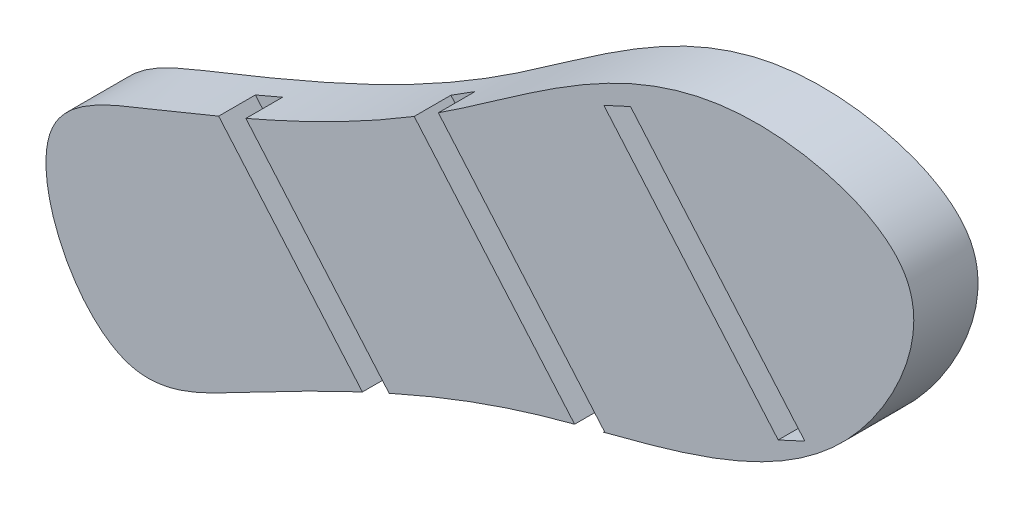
ISO-10303-21;
HEADER;
FILE_DESCRIPTION(('STEP AP214'),'2;1');
FILE_NAME('part.step','',(''),(''),'','','');
FILE_SCHEMA(('AUTOMOTIVE_DESIGN { 1 0 10303 214 1 1 1 1 }'));
ENDSEC;
DATA;
#1=APPLICATION_CONTEXT('core data for automotive mechanical design processes');
#2=APPLICATION_PROTOCOL_DEFINITION('international standard','automotive_design',2000,#1);
#3=PRODUCT_CONTEXT('',#1,'mechanical');
#4=PRODUCT('Part','Part','',(#3));
#5=PRODUCT_RELATED_PRODUCT_CATEGORY('part','',(#4));
#6=PRODUCT_DEFINITION_FORMATION('','',#4);
#7=PRODUCT_DEFINITION_CONTEXT('part definition',#1,'design');
#8=PRODUCT_DEFINITION('design','',#6,#7);
#9=PRODUCT_DEFINITION_SHAPE('','',#8);
#10=(LENGTH_UNIT() NAMED_UNIT(*) SI_UNIT(.MILLI.,.METRE.));
#11=(NAMED_UNIT(*) PLANE_ANGLE_UNIT() SI_UNIT($,.RADIAN.));
#12=(NAMED_UNIT(*) SI_UNIT($,.STERADIAN.) SOLID_ANGLE_UNIT());
#13=UNCERTAINTY_MEASURE_WITH_UNIT(LENGTH_MEASURE(1.E-05),#10,'distance_accuracy_value','');
#14=(GEOMETRIC_REPRESENTATION_CONTEXT(3) GLOBAL_UNCERTAINTY_ASSIGNED_CONTEXT((#13)) GLOBAL_UNIT_ASSIGNED_CONTEXT((#10,
#11,#12)) REPRESENTATION_CONTEXT('',''));
#15=CARTESIAN_POINT('',(0.,0.,0.));
#16=DIRECTION('',(0.,0.,1.));
#17=DIRECTION('',(1.,0.,0.));
#18=AXIS2_PLACEMENT_3D('',#15,#16,#17);
#19=CARTESIAN_POINT('',(431.734976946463,343.776693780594,-16.));
#20=CARTESIAN_POINT('',(430.437738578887,340.897420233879,-16.));
#21=CARTESIAN_POINT('',(434.386282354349,332.342242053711,-16.));
#22=CARTESIAN_POINT('',(445.921336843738,338.542902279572,-16.));
#23=CARTESIAN_POINT('',(458.123888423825,344.531424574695,-16.));
#24=CARTESIAN_POINT('',(474.741212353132,346.583012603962,-16.));
#25=CARTESIAN_POINT('',(480.557784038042,360.803442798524,-16.));
#26=CARTESIAN_POINT('',(465.962705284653,365.603111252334,-16.));
#27=CARTESIAN_POINT('',(453.620501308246,354.288763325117,-16.));
#28=CARTESIAN_POINT('',(441.146604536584,348.888155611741,-16.));
#29=CARTESIAN_POINT('',(432.524056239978,345.528087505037,-16.));
#30=CARTESIAN_POINT('',(431.734976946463,343.776693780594,-16.));
#31=B_SPLINE_CURVE_WITH_KNOTS('',3,(#19,#20,#21,#22,#23,#24,#25,#26,#27,#28,#29,#30),
.UNSPECIFIED.,.T.,.F.,(4,1,1,1,1,1,1,1,1,4),(0.,0.0878712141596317,0.141321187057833,
0.299528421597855,0.475305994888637,0.543935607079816,0.612565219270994,0.788342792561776,
0.946550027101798,1.),.UNSPECIFIED.);
#32=DIRECTION('',(0.,0.,1.));
#33=VECTOR('',#32,1.);
#34=SURFACE_OF_LINEAR_EXTRUSION('',#31,#33);
#35=CARTESIAN_POINT('',(431.734976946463,343.776693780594,-16.));
#36=VERTEX_POINT('',#35);
#37=EDGE_CURVE('E223',#36,#36,#31,.T.);
#38=ORIENTED_EDGE('',*,*,#37,.T.);
#39=EDGE_LOOP('',(#38));
#40=FACE_BOUND('',#39,.T.);
#41=DIRECTION('',(0.,0.,1.));
#42=VECTOR('',#41,1.);
#43=CARTESIAN_POINT('',(451.438377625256,354.15385663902,-16.));
#44=LINE('',#43,#42);
#45=CARTESIAN_POINT('',(451.438377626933,354.153856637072,-12.5));
#46=VERTEX_POINT('',#45);
#47=CARTESIAN_POINT('',(451.438377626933,354.153856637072,-14.5));
#48=VERTEX_POINT('',#47);
#49=EDGE_CURVE('E215',#46,#48,#44,.F.);
#50=ORIENTED_EDGE('',*,*,#49,.T.);
#51=CARTESIAN_POINT('',(431.734976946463,343.776693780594,-14.5));
#52=CARTESIAN_POINT('',(430.437738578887,340.897420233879,-14.5));
#53=CARTESIAN_POINT('',(434.386282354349,332.342242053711,-14.5));
#54=CARTESIAN_POINT('',(445.921336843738,338.542902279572,-14.5));
#55=CARTESIAN_POINT('',(458.123888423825,344.531424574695,-14.5));
#56=CARTESIAN_POINT('',(474.741212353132,346.583012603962,-14.5));
#57=CARTESIAN_POINT('',(480.557784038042,360.803442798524,-14.5));
#58=CARTESIAN_POINT('',(465.962705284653,365.603111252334,-14.5));
#59=CARTESIAN_POINT('',(453.620501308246,354.288763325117,-14.5));
#60=CARTESIAN_POINT('',(441.146604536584,348.888155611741,-14.5));
#61=CARTESIAN_POINT('',(432.524056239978,345.528087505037,-14.5));
#62=CARTESIAN_POINT('',(431.734976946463,343.776693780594,-14.5));
#63=B_SPLINE_CURVE_WITH_KNOTS('',3,(#51,#52,#53,#54,#55,#56,#57,#58,#59,#60,#61,#62),
.UNSPECIFIED.,.T.,.F.,(4,1,1,1,1,1,1,1,1,4),(0.,0.0878712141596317,0.141321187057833,
0.299528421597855,0.475305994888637,0.543935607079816,0.612565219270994,0.788342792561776,
0.946550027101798,1.),.UNSPECIFIED.);
#64=CARTESIAN_POINT('',(452.753720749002,354.983966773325,-14.5));
#65=VERTEX_POINT('',#64);
#66=EDGE_CURVE('E11',#48,#65,#63,.F.);
#67=ORIENTED_EDGE('',*,*,#66,.T.);
#68=DIRECTION('',(0.,0.,1.));
#69=VECTOR('',#68,1.);
#70=CARTESIAN_POINT('',(452.753720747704,354.983966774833,-16.));
#71=LINE('',#70,#69);
#72=CARTESIAN_POINT('',(452.753720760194,354.983966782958,-12.5));
#73=VERTEX_POINT('',#72);
#74=EDGE_CURVE('E207',#65,#73,#71,.T.);
#75=ORIENTED_EDGE('',*,*,#74,.T.);
#76=CARTESIAN_POINT('',(431.734976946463,343.776693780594,-12.5));
#77=CARTESIAN_POINT('',(430.437738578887,340.897420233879,-12.5));
#78=CARTESIAN_POINT('',(434.386282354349,332.342242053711,-12.5));
#79=CARTESIAN_POINT('',(445.921336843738,338.542902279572,-12.5));
#80=CARTESIAN_POINT('',(458.123888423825,344.531424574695,-12.5));
#81=CARTESIAN_POINT('',(474.741212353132,346.583012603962,-12.5));
#82=CARTESIAN_POINT('',(480.557784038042,360.803442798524,-12.5));
#83=CARTESIAN_POINT('',(465.962705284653,365.603111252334,-12.5));
#84=CARTESIAN_POINT('',(453.620501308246,354.288763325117,-12.5));
#85=CARTESIAN_POINT('',(441.146604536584,348.888155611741,-12.5));
#86=CARTESIAN_POINT('',(432.524056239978,345.528087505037,-12.5));
#87=CARTESIAN_POINT('',(431.734976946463,343.776693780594,-12.5));
#88=B_SPLINE_CURVE_WITH_KNOTS('',3,(#76,#77,#78,#79,#80,#81,#82,#83,#84,#85,#86,#87),
.UNSPECIFIED.,.T.,.F.,(4,1,1,1,1,1,1,1,1,4),(0.,0.0878712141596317,0.141321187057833,
0.299528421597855,0.475305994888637,0.543935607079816,0.612565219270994,0.788342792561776,
0.946550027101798,1.),.UNSPECIFIED.);
#89=CARTESIAN_POINT('',(461.754350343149,344.415338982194,-12.5));
#90=VERTEX_POINT('',#89);
#91=EDGE_CURVE('E285',#90,#73,#88,.T.);
#92=ORIENTED_EDGE('',*,*,#91,.F.);
#93=DIRECTION('',(0.,0.,1.));
#94=VECTOR('',#93,1.);
#95=CARTESIAN_POINT('',(461.754350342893,344.415338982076,-16.));
#96=LINE('',#95,#94);
#97=CARTESIAN_POINT('',(461.75435034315,344.415338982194,-14.5));
#98=VERTEX_POINT('',#97);
#99=EDGE_CURVE('E211',#90,#98,#96,.F.);
#100=ORIENTED_EDGE('',*,*,#99,.T.);
#101=CARTESIAN_POINT('',(460.176471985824,344.002247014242,-14.5));
#102=VERTEX_POINT('',#101);
#103=EDGE_CURVE('E43',#98,#102,#63,.F.);
#104=ORIENTED_EDGE('',*,*,#103,.T.);
#105=DIRECTION('',(0.,0.,1.));
#106=VECTOR('',#105,1.);
#107=CARTESIAN_POINT('',(460.176471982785,344.002247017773,-16.));
#108=LINE('',#107,#106);
#109=CARTESIAN_POINT('',(460.176471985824,344.002247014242,-12.5));
#110=VERTEX_POINT('',#109);
#111=EDGE_CURVE('E219',#102,#110,#108,.T.);
#112=ORIENTED_EDGE('',*,*,#111,.T.);
#113=CARTESIAN_POINT('',(450.072635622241,340.412036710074,-12.5));
#114=VERTEX_POINT('',#113);
#115=EDGE_CURVE('E230',#114,#110,#88,.T.);
#116=ORIENTED_EDGE('',*,*,#115,.F.);
#117=DIRECTION('',(0.,0.,1.));
#118=VECTOR('',#117,1.);
#119=CARTESIAN_POINT('',(450.07263562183,340.412036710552,-16.));
#120=LINE('',#119,#118);
#121=CARTESIAN_POINT('',(450.072635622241,340.412036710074,-14.5));
#122=VERTEX_POINT('',#121);
#123=EDGE_CURVE('E195',#114,#122,#120,.F.);
#124=ORIENTED_EDGE('',*,*,#123,.T.);
#125=CARTESIAN_POINT('',(431.734976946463,343.776693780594,-14.5));
#126=CARTESIAN_POINT('',(430.437738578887,340.897420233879,-14.5));
#127=CARTESIAN_POINT('',(434.386282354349,332.342242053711,-14.5));
#128=CARTESIAN_POINT('',(445.921336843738,338.542902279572,-14.5));
#129=CARTESIAN_POINT('',(458.123888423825,344.531424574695,-14.5));
#130=CARTESIAN_POINT('',(474.741212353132,346.583012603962,-14.5));
#131=CARTESIAN_POINT('',(480.557784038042,360.803442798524,-14.5));
#132=CARTESIAN_POINT('',(465.962705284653,365.603111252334,-14.5));
#133=CARTESIAN_POINT('',(453.620501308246,354.288763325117,-14.5));
#134=CARTESIAN_POINT('',(441.146604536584,348.888155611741,-14.5));
#135=CARTESIAN_POINT('',(432.524056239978,345.528087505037,-14.5));
#136=CARTESIAN_POINT('',(431.734976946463,343.776693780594,-14.5));
#137=B_SPLINE_CURVE_WITH_KNOTS('',3,(#125,#126,#127,#128,#129,#130,#131,#132,#133,#134,#135,
#136),.UNSPECIFIED.,.T.,.F.,(4,1,1,1,1,1,1,1,1,4),(0.,0.0878712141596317,0.141321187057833,
0.299528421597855,0.475305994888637,0.543935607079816,0.612565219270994,0.788342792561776,
0.946550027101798,1.),.UNSPECIFIED.);
#138=CARTESIAN_POINT('',(448.617521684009,339.744307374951,-14.5));
#139=VERTEX_POINT('',#138);
#140=EDGE_CURVE('E253',#122,#139,#137,.F.);
#141=ORIENTED_EDGE('',*,*,#140,.T.);
#142=DIRECTION('',(0.,0.,1.));
#143=VECTOR('',#142,1.);
#144=CARTESIAN_POINT('',(448.617521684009,339.744307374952,-16.));
#145=LINE('',#144,#143);
#146=CARTESIAN_POINT('',(448.617521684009,339.744307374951,-12.5));
#147=VERTEX_POINT('',#146);
#148=EDGE_CURVE('E203',#139,#147,#145,.T.);
#149=ORIENTED_EDGE('',*,*,#148,.T.);
#150=CARTESIAN_POINT('',(440.786957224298,348.84158079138,-12.5));
#151=VERTEX_POINT('',#150);
#152=EDGE_CURVE('E222',#151,#147,#88,.T.);
#153=ORIENTED_EDGE('',*,*,#152,.F.);
#154=DIRECTION('',(0.,0.,1.));
#155=VECTOR('',#154,1.);
#156=CARTESIAN_POINT('',(440.786957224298,348.84158079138,-16.));
#157=LINE('',#156,#155);
#158=CARTESIAN_POINT('',(440.786957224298,348.84158079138,-14.5));
#159=VERTEX_POINT('',#158);
#160=EDGE_CURVE('E199',#151,#159,#157,.F.);
#161=ORIENTED_EDGE('',*,*,#160,.T.);
#162=CARTESIAN_POINT('',(442.270356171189,349.476449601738,-14.5));
#163=VERTEX_POINT('',#162);
#164=EDGE_CURVE('E258',#159,#163,#137,.F.);
#165=ORIENTED_EDGE('',*,*,#164,.T.);
#166=DIRECTION('',(0.,0.,1.));
#167=VECTOR('',#166,1.);
#168=CARTESIAN_POINT('',(442.270356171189,349.476449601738,-16.));
#169=LINE('',#168,#167);
#170=CARTESIAN_POINT('',(442.270356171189,349.476449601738,-12.5));
#171=VERTEX_POINT('',#170);
#172=EDGE_CURVE('E191',#163,#171,#169,.T.);
#173=ORIENTED_EDGE('',*,*,#172,.T.);
#174=EDGE_CURVE('E239',#46,#171,#88,.T.);
#175=ORIENTED_EDGE('',*,*,#174,.F.);
#176=EDGE_LOOP('',(#50,#67,#75,#92,#100,#104,#112,#116,#124,#141,#149,#153,#161,#165,#173,#175));
#177=FACE_BOUND('',#176,.T.);
#178=ADVANCED_FACE('F39',(#40,#177),#34,.T.);
#179=CARTESIAN_POINT('',(477.88969650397,354.97162670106,-12.5));
#180=DIRECTION('',(0.,0.,-1.));
#181=DIRECTION('',(1.,0.,0.));
#182=AXIS2_PLACEMENT_3D('',#179,#180,#181);
#183=PLANE('',#182);
#184=DIRECTION('',(-0.652370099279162,0.757900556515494,0.));
#185=VECTOR('',#184,1.);
#186=CARTESIAN_POINT('',(462.291376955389,341.545225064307,-12.5));
#187=LINE('',#186,#185);
#188=EDGE_CURVE('E251',#110,#46,#187,.T.);
#189=ORIENTED_EDGE('',*,*,#188,.T.);
#190=ORIENTED_EDGE('',*,*,#174,.T.);
#191=DIRECTION('',(0.652370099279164,-0.757900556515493,0.));
#192=VECTOR('',#191,1.);
#193=CARTESIAN_POINT('',(454.712485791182,335.021622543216,-12.5));
#194=LINE('',#193,#192);
#195=EDGE_CURVE('E65',#171,#114,#194,.T.);
#196=ORIENTED_EDGE('',*,*,#195,.T.);
#197=ORIENTED_EDGE('',*,*,#115,.T.);
#198=EDGE_LOOP('',(#189,#190,#196,#197));
#199=FACE_BOUND('',#198,.T.);
#200=ADVANCED_FACE('F283',(#199),#183,.F.);
#201=DIRECTION('',(0.652370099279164,-0.757900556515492,0.));
#202=VECTOR('',#201,1.);
#203=CARTESIAN_POINT('',(471.266131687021,348.805391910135,-12.5));
#204=LINE('',#203,#202);
#205=CARTESIAN_POINT('',(461.767479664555,359.840590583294,-12.5));
#206=VERTEX_POINT('',#205);
#207=CARTESIAN_POINT('',(471.266131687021,348.805391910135,-12.5));
#208=VERTEX_POINT('',#207);
#209=EDGE_CURVE('E161',#206,#208,#204,.T.);
#210=ORIENTED_EDGE('',*,*,#209,.F.);
#211=DIRECTION('',(-0.907959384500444,-0.419058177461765,0.));
#212=VECTOR('',#211,1.);
#213=CARTESIAN_POINT('',(461.767479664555,359.840590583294,-12.5));
#214=LINE('',#213,#212);
#215=CARTESIAN_POINT('',(463.220214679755,360.511083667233,-12.5));
#216=VERTEX_POINT('',#215);
#217=EDGE_CURVE('E157',#216,#206,#214,.T.);
#218=ORIENTED_EDGE('',*,*,#217,.F.);
#219=DIRECTION('',(-0.652370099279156,0.757900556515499,0.));
#220=VECTOR('',#219,1.);
#221=CARTESIAN_POINT('',(463.220214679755,360.511083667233,-12.5));
#222=LINE('',#221,#220);
#223=CARTESIAN_POINT('',(472.718866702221,349.475884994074,-12.5));
#224=VERTEX_POINT('',#223);
#225=EDGE_CURVE('E451',#224,#216,#222,.T.);
#226=ORIENTED_EDGE('',*,*,#225,.F.);
#227=DIRECTION('',(0.907959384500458,0.419058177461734,0.));
#228=VECTOR('',#227,1.);
#229=CARTESIAN_POINT('',(472.718866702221,349.475884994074,-12.5));
#230=LINE('',#229,#228);
#231=EDGE_CURVE('E453',#208,#224,#230,.T.);
#232=ORIENTED_EDGE('',*,*,#231,.F.);
#233=EDGE_LOOP('',(#210,#218,#226,#232));
#234=FACE_BOUND('',#233,.T.);
#235=DIRECTION('',(-0.907959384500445,-0.419058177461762,0.));
#236=VECTOR('',#235,1.);
#237=CARTESIAN_POINT('',(479.072711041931,352.408428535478,-12.5));
#238=LINE('',#237,#236);
#239=CARTESIAN_POINT('',(461.823354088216,344.447186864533,-12.5));
#240=VERTEX_POINT('',#239);
#241=EDGE_CURVE('E248',#240,#90,#238,.T.);
#242=ORIENTED_EDGE('',*,*,#241,.T.);
#243=ORIENTED_EDGE('',*,*,#91,.T.);
#244=DIRECTION('',(-0.65237009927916,0.757900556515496,0.));
#245=VECTOR('',#244,1.);
#246=CARTESIAN_POINT('',(452.32470206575,355.482385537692,-12.5));
#247=LINE('',#246,#245);
#248=EDGE_CURVE('E163',#240,#73,#247,.T.);
#249=ORIENTED_EDGE('',*,*,#248,.F.);
#250=EDGE_LOOP('',(#242,#243,#249));
#251=FACE_BOUND('',#250,.T.);
#252=ADVANCED_FACE('F303',(#234,#251),#183,.F.);
#253=DIRECTION('',(-0.652370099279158,0.757900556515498,0.));
#254=VECTOR('',#253,1.);
#255=CARTESIAN_POINT('',(453.54650253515,334.017991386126,-12.5));
#256=LINE('',#255,#254);
#257=EDGE_CURVE('E245',#147,#151,#256,.T.);
#258=ORIENTED_EDGE('',*,*,#257,.T.);
#259=ORIENTED_EDGE('',*,*,#152,.T.);
#260=EDGE_LOOP('',(#258,#259));
#261=FACE_BOUND('',#260,.T.);
#262=ADVANCED_FACE('F300',(#261),#183,.F.);
#263=CARTESIAN_POINT('',(477.88969650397,354.97162670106,-16.));
#264=DIRECTION('',(0.,0.,-1.));
#265=DIRECTION('',(1.,0.,0.));
#266=AXIS2_PLACEMENT_3D('',#263,#264,#265);
#267=PLANE('',#266);
#268=ORIENTED_EDGE('',*,*,#37,.F.);
#269=EDGE_LOOP('',(#268));
#270=FACE_BOUND('',#269,.T.);
#271=ADVANCED_FACE('F302',(#270),#267,.T.);
#272=CARTESIAN_POINT('',(0.,0.,-14.5));
#273=DIRECTION('',(0.,0.,1.));
#274=DIRECTION('',(-1.,0.,0.));
#275=AXIS2_PLACEMENT_3D('',#272,#273,#274);
#276=PLANE('',#275);
#277=ORIENTED_EDGE('',*,*,#164,.F.);
#278=DIRECTION('',(0.652370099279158,-0.757900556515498,0.));
#279=VECTOR('',#278,1.);
#280=CARTESIAN_POINT('',(449.47510645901,338.747995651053,-14.5));
#281=LINE('',#280,#279);
#282=EDGE_CURVE('E185',#159,#139,#281,.T.);
#283=ORIENTED_EDGE('',*,*,#282,.T.);
#284=ORIENTED_EDGE('',*,*,#140,.F.);
#285=DIRECTION('',(-0.652370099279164,0.757900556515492,0.));
#286=VECTOR('',#285,1.);
#287=CARTESIAN_POINT('',(441.429189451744,350.453687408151,-14.5));
#288=LINE('',#287,#286);
#289=EDGE_CURVE('E188',#122,#163,#288,.T.);
#290=ORIENTED_EDGE('',*,*,#289,.T.);
#291=EDGE_LOOP('',(#277,#283,#284,#290));
#292=FACE_BOUND('',#291,.T.);
#293=ADVANCED_FACE('F293',(#292),#276,.T.);
#294=CARTESIAN_POINT('',(449.47510645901,338.747995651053,-14.5));
#295=DIRECTION('',(0.757900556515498,0.652370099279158,0.));
#296=DIRECTION('',(-0.652370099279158,0.757900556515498,0.));
#297=AXIS2_PLACEMENT_3D('',#294,#295,#296);
#298=PLANE('',#297);
#299=ORIENTED_EDGE('',*,*,#148,.F.);
#300=ORIENTED_EDGE('',*,*,#282,.F.);
#301=ORIENTED_EDGE('',*,*,#160,.F.);
#302=ORIENTED_EDGE('',*,*,#257,.F.);
#303=EDGE_LOOP('',(#299,#300,#301,#302));
#304=FACE_BOUND('',#303,.T.);
#305=ADVANCED_FACE('F297',(#304),#298,.T.);
#306=CARTESIAN_POINT('',(441.429189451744,350.453687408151,-14.5));
#307=DIRECTION('',(-0.757900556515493,-0.652370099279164,0.));
#308=DIRECTION('',(0.652370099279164,-0.757900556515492,0.));
#309=AXIS2_PLACEMENT_3D('',#306,#307,#308);
#310=PLANE('',#309);
#311=ORIENTED_EDGE('',*,*,#123,.F.);
#312=ORIENTED_EDGE('',*,*,#195,.F.);
#313=ORIENTED_EDGE('',*,*,#172,.F.);
#314=ORIENTED_EDGE('',*,*,#289,.F.);
#315=EDGE_LOOP('',(#311,#312,#313,#314));
#316=FACE_BOUND('',#315,.T.);
#317=ADVANCED_FACE('F291',(#316),#310,.T.);
#318=CARTESIAN_POINT('',(471.266131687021,348.805391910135,-14.5));
#319=DIRECTION('',(0.757900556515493,0.652370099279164,0.));
#320=DIRECTION('',(-0.652370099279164,0.757900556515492,0.));
#321=AXIS2_PLACEMENT_3D('',#318,#319,#320);
#322=PLANE('',#321);
#323=ORIENTED_EDGE('',*,*,#209,.T.);
#324=DIRECTION('',(0.,0.,1.));
#325=VECTOR('',#324,1.);
#326=CARTESIAN_POINT('',(471.266131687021,348.805391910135,-14.5));
#327=LINE('',#326,#325);
#328=CARTESIAN_POINT('',(471.266131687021,348.805391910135,-14.5));
#329=VERTEX_POINT('',#328);
#330=EDGE_CURVE('E145',#329,#208,#327,.T.);
#331=ORIENTED_EDGE('',*,*,#330,.F.);
#332=DIRECTION('',(0.652370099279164,-0.757900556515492,0.));
#333=VECTOR('',#332,1.);
#334=CARTESIAN_POINT('',(471.266131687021,348.805391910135,-14.5));
#335=LINE('',#334,#333);
#336=CARTESIAN_POINT('',(461.767479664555,359.840590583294,-14.5));
#337=VERTEX_POINT('',#336);
#338=EDGE_CURVE('E152',#337,#329,#335,.T.);
#339=ORIENTED_EDGE('',*,*,#338,.F.);
#340=DIRECTION('',(0.,0.,1.));
#341=VECTOR('',#340,1.);
#342=CARTESIAN_POINT('',(461.767479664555,359.840590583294,-14.5));
#343=LINE('',#342,#341);
#344=EDGE_CURVE('E57',#337,#206,#343,.T.);
#345=ORIENTED_EDGE('',*,*,#344,.T.);
#346=EDGE_LOOP('',(#323,#331,#339,#345));
#347=FACE_BOUND('',#346,.T.);
#348=ADVANCED_FACE('F159',(#347),#322,.T.);
#349=CARTESIAN_POINT('',(472.718866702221,349.475884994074,-14.5));
#350=DIRECTION('',(-0.419058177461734,0.907959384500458,0.));
#351=DIRECTION('',(-0.907959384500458,-0.419058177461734,0.));
#352=AXIS2_PLACEMENT_3D('',#349,#350,#351);
#353=PLANE('',#352);
#354=ORIENTED_EDGE('',*,*,#231,.T.);
#355=DIRECTION('',(0.,0.,1.));
#356=VECTOR('',#355,1.);
#357=CARTESIAN_POINT('',(472.718866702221,349.475884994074,-14.5));
#358=LINE('',#357,#356);
#359=CARTESIAN_POINT('',(472.718866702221,349.475884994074,-14.5));
#360=VERTEX_POINT('',#359);
#361=EDGE_CURVE('E147',#360,#224,#358,.T.);
#362=ORIENTED_EDGE('',*,*,#361,.F.);
#363=DIRECTION('',(0.907959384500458,0.419058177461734,0.));
#364=VECTOR('',#363,1.);
#365=CARTESIAN_POINT('',(472.718866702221,349.475884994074,-14.5));
#366=LINE('',#365,#364);
#367=EDGE_CURVE('E140',#329,#360,#366,.T.);
#368=ORIENTED_EDGE('',*,*,#367,.F.);
#369=ORIENTED_EDGE('',*,*,#330,.T.);
#370=EDGE_LOOP('',(#354,#362,#368,#369));
#371=FACE_BOUND('',#370,.T.);
#372=ADVANCED_FACE('F143',(#371),#353,.T.);
#373=CARTESIAN_POINT('',(463.220214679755,360.511083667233,-14.5));
#374=DIRECTION('',(-0.757900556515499,-0.652370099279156,0.));
#375=DIRECTION('',(0.652370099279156,-0.757900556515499,0.));
#376=AXIS2_PLACEMENT_3D('',#373,#374,#375);
#377=PLANE('',#376);
#378=ORIENTED_EDGE('',*,*,#225,.T.);
#379=DIRECTION('',(0.,0.,1.));
#380=VECTOR('',#379,1.);
#381=CARTESIAN_POINT('',(463.220214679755,360.511083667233,-14.5));
#382=LINE('',#381,#380);
#383=CARTESIAN_POINT('',(463.220214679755,360.511083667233,-14.5));
#384=VERTEX_POINT('',#383);
#385=EDGE_CURVE('E169',#384,#216,#382,.T.);
#386=ORIENTED_EDGE('',*,*,#385,.F.);
#387=DIRECTION('',(-0.652370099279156,0.757900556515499,0.));
#388=VECTOR('',#387,1.);
#389=CARTESIAN_POINT('',(463.220214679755,360.511083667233,-14.5));
#390=LINE('',#389,#388);
#391=EDGE_CURVE('E151',#360,#384,#390,.T.);
#392=ORIENTED_EDGE('',*,*,#391,.F.);
#393=ORIENTED_EDGE('',*,*,#361,.T.);
#394=EDGE_LOOP('',(#378,#386,#392,#393));
#395=FACE_BOUND('',#394,.T.);
#396=ADVANCED_FACE('F376',(#395),#377,.T.);
#397=CARTESIAN_POINT('',(461.767479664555,359.840590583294,-14.5));
#398=DIRECTION('',(0.419058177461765,-0.907959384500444,0.));
#399=DIRECTION('',(0.907959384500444,0.419058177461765,0.));
#400=AXIS2_PLACEMENT_3D('',#397,#398,#399);
#401=PLANE('',#400);
#402=ORIENTED_EDGE('',*,*,#217,.T.);
#403=ORIENTED_EDGE('',*,*,#344,.F.);
#404=DIRECTION('',(-0.907959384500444,-0.419058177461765,0.));
#405=VECTOR('',#404,1.);
#406=CARTESIAN_POINT('',(461.767479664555,359.840590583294,-14.5));
#407=LINE('',#406,#405);
#408=EDGE_CURVE('E155',#384,#337,#407,.T.);
#409=ORIENTED_EDGE('',*,*,#408,.F.);
#410=ORIENTED_EDGE('',*,*,#385,.T.);
#411=EDGE_LOOP('',(#402,#403,#409,#410));
#412=FACE_BOUND('',#411,.T.);
#413=ADVANCED_FACE('F385',(#412),#401,.T.);
#414=CARTESIAN_POINT('',(0.,0.,-14.5));
#415=DIRECTION('',(0.,0.,1.));
#416=DIRECTION('',(-1.,0.,0.));
#417=AXIS2_PLACEMENT_3D('',#414,#415,#416);
#418=PLANE('',#417);
#419=ORIENTED_EDGE('',*,*,#338,.T.);
#420=ORIENTED_EDGE('',*,*,#367,.T.);
#421=ORIENTED_EDGE('',*,*,#391,.T.);
#422=ORIENTED_EDGE('',*,*,#408,.T.);
#423=EDGE_LOOP('',(#419,#420,#421,#422));
#424=FACE_BOUND('',#423,.T.);
#425=ADVANCED_FACE('F154',(#424),#418,.T.);
#426=CARTESIAN_POINT('',(0.,0.,-14.5));
#427=DIRECTION('',(0.,0.,1.));
#428=DIRECTION('',(-1.,0.,0.));
#429=AXIS2_PLACEMENT_3D('',#426,#427,#428);
#430=PLANE('',#429);
#431=ORIENTED_EDGE('',*,*,#66,.F.);
#432=DIRECTION('',(0.652370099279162,-0.757900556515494,0.));
#433=VECTOR('',#432,1.);
#434=CARTESIAN_POINT('',(460.370619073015,343.776693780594,-14.5));
#435=LINE('',#434,#433);
#436=EDGE_CURVE('E167',#48,#102,#435,.T.);
#437=ORIENTED_EDGE('',*,*,#436,.T.);
#438=ORIENTED_EDGE('',*,*,#103,.F.);
#439=DIRECTION('',(0.907959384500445,0.419058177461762,0.));
#440=VECTOR('',#439,1.);
#441=CARTESIAN_POINT('',(461.823354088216,344.447186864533,-14.5));
#442=LINE('',#441,#440);
#443=CARTESIAN_POINT('',(461.823354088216,344.447186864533,-14.5));
#444=VERTEX_POINT('',#443);
#445=EDGE_CURVE('E175',#98,#444,#442,.T.);
#446=ORIENTED_EDGE('',*,*,#445,.T.);
#447=DIRECTION('',(-0.65237009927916,0.757900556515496,0.));
#448=VECTOR('',#447,1.);
#449=CARTESIAN_POINT('',(452.32470206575,355.482385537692,-14.5));
#450=LINE('',#449,#448);
#451=EDGE_CURVE('E179',#444,#65,#450,.T.);
#452=ORIENTED_EDGE('',*,*,#451,.T.);
#453=EDGE_LOOP('',(#431,#437,#438,#446,#452));
#454=FACE_BOUND('',#453,.T.);
#455=ADVANCED_FACE('F276',(#454),#430,.T.);
#456=CARTESIAN_POINT('',(460.370619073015,343.776693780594,-14.5));
#457=DIRECTION('',(0.757900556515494,0.652370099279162,0.));
#458=DIRECTION('',(-0.652370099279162,0.757900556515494,0.));
#459=AXIS2_PLACEMENT_3D('',#456,#457,#458);
#460=PLANE('',#459);
#461=ORIENTED_EDGE('',*,*,#111,.F.);
#462=ORIENTED_EDGE('',*,*,#436,.F.);
#463=ORIENTED_EDGE('',*,*,#49,.F.);
#464=ORIENTED_EDGE('',*,*,#188,.F.);
#465=EDGE_LOOP('',(#461,#462,#463,#464));
#466=FACE_BOUND('',#465,.T.);
#467=ADVANCED_FACE('F279',(#466),#460,.T.);
#468=CARTESIAN_POINT('',(461.823354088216,344.447186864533,-14.5));
#469=DIRECTION('',(-0.419058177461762,0.907959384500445,0.));
#470=DIRECTION('',(-0.907959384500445,-0.419058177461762,0.));
#471=AXIS2_PLACEMENT_3D('',#468,#469,#470);
#472=PLANE('',#471);
#473=ORIENTED_EDGE('',*,*,#99,.F.);
#474=ORIENTED_EDGE('',*,*,#241,.F.);
#475=DIRECTION('',(0.,0.,1.));
#476=VECTOR('',#475,1.);
#477=CARTESIAN_POINT('',(461.823354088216,344.447186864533,-14.5));
#478=LINE('',#477,#476);
#479=EDGE_CURVE('E181',#444,#240,#478,.T.);
#480=ORIENTED_EDGE('',*,*,#479,.F.);
#481=ORIENTED_EDGE('',*,*,#445,.F.);
#482=EDGE_LOOP('',(#473,#474,#480,#481));
#483=FACE_BOUND('',#482,.T.);
#484=ADVANCED_FACE('F420',(#483),#472,.T.);
#485=CARTESIAN_POINT('',(452.32470206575,355.482385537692,-14.5));
#486=DIRECTION('',(-0.757900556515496,-0.65237009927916,0.));
#487=DIRECTION('',(0.65237009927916,-0.757900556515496,0.));
#488=AXIS2_PLACEMENT_3D('',#485,#486,#487);
#489=PLANE('',#488);
#490=ORIENTED_EDGE('',*,*,#74,.F.);
#491=ORIENTED_EDGE('',*,*,#451,.F.);
#492=ORIENTED_EDGE('',*,*,#479,.T.);
#493=ORIENTED_EDGE('',*,*,#248,.T.);
#494=EDGE_LOOP('',(#490,#491,#492,#493));
#495=FACE_BOUND('',#494,.T.);
#496=ADVANCED_FACE('F429',(#495),#489,.T.);
#497=CLOSED_SHELL('',(#178,#200,#252,#262,#271,#293,#305,#317,#348,#372,#396,#413,#425,#455,
#467,#484,#496));
#498=MANIFOLD_SOLID_BREP('B2',#497);
#499=ADVANCED_BREP_SHAPE_REPRESENTATION('',(#18,#498),#14);
#500=SHAPE_DEFINITION_REPRESENTATION(#9,#499);
ENDSEC;
END-ISO-10303-21;
